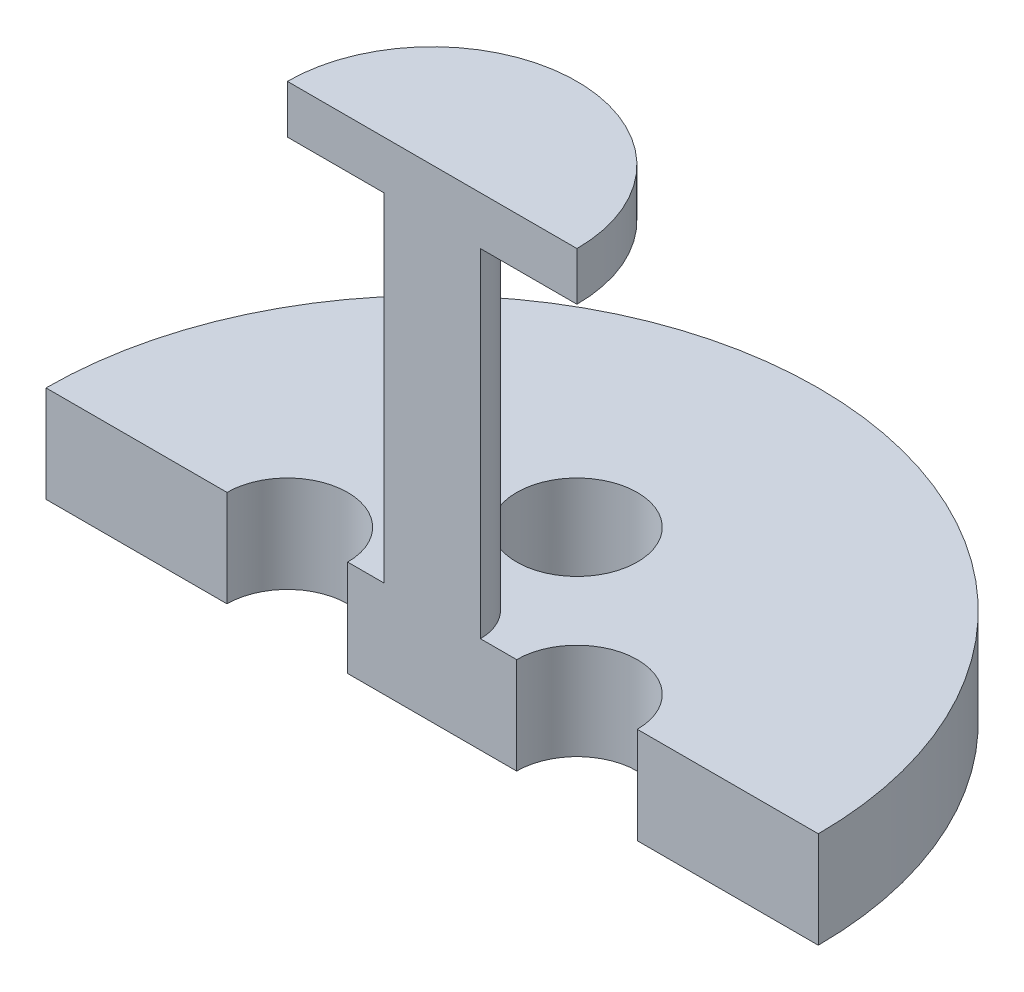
from build123d import *

# Parameters (mm, degrees)
ENL_V_MAT_EXTRU_2_REACH      = 17.1
ESQUISSE3_R                  = 1.25
R_P_TITION_CIRCULAIRE1_COUNT = 4
ESQUISSE2_W                  = 16
ESQUISSE2_H                  = 8
COUPE_DEPTH                  = 16.099668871


with BuildPart() as part:
    # Esquisse1 → R_volution1 (revolve)
    with BuildSketch(Plane.XY):
        Polygon((0, 10), (-3, 10), (-3, 9), (-1, 9), (-1, 2), (-8, 2), (-8, 0), (0, 0), align=None)
    revolve(axis=Axis((0, 71.591026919, 0), (0, -1, 0)))

    # Esquisse3 → Enl_v. mat.-Extru.2 (cut, up to next)
    with BuildSketch(Plane.XZ, mode=Mode.PRIVATE) as enl_v_mat_extru_2_sk1:
        with Locations((3, 0)):
            Circle(ESQUISSE3_R)
    enl_v_mat_extru_2_tool1 = extrude(enl_v_mat_extru_2_sk1.sketch, amount=-ENL_V_MAT_EXTRU_2_REACH, mode=Mode.PRIVATE) & part.part
    enl_v_mat_extru_2 = enl_v_mat_extru_2_tool1.solids().sort_by_distance((3, 0, 0))[0]
    add(enl_v_mat_extru_2, mode=Mode.SUBTRACT)

    # R_p_tition circulaire1: Enl_v. mat.-Extru.2 ×4 about axis
    r_p_tition_circulaire1_axis = Axis((0, 2, 0), (0, 1, 0))
    for i in range(1, R_P_TITION_CIRCULAIRE1_COUNT):
        add(enl_v_mat_extru_2.rotate(r_p_tition_circulaire1_axis, i * 360 / R_P_TITION_CIRCULAIRE1_COUNT), mode=Mode.SUBTRACT)

    # Esquisse2 → Coupe (cut, through all)
    with BuildSketch(Plane(origin=(0, 10, 0), x_dir=(-1, 0, 0), z_dir=(0, 1, 0))):
        with Locations((0, 4)):
            Rectangle(ESQUISSE2_W, ESQUISSE2_H)
    extrude(amount=-COUPE_DEPTH, mode=Mode.SUBTRACT)


solid = part.part
